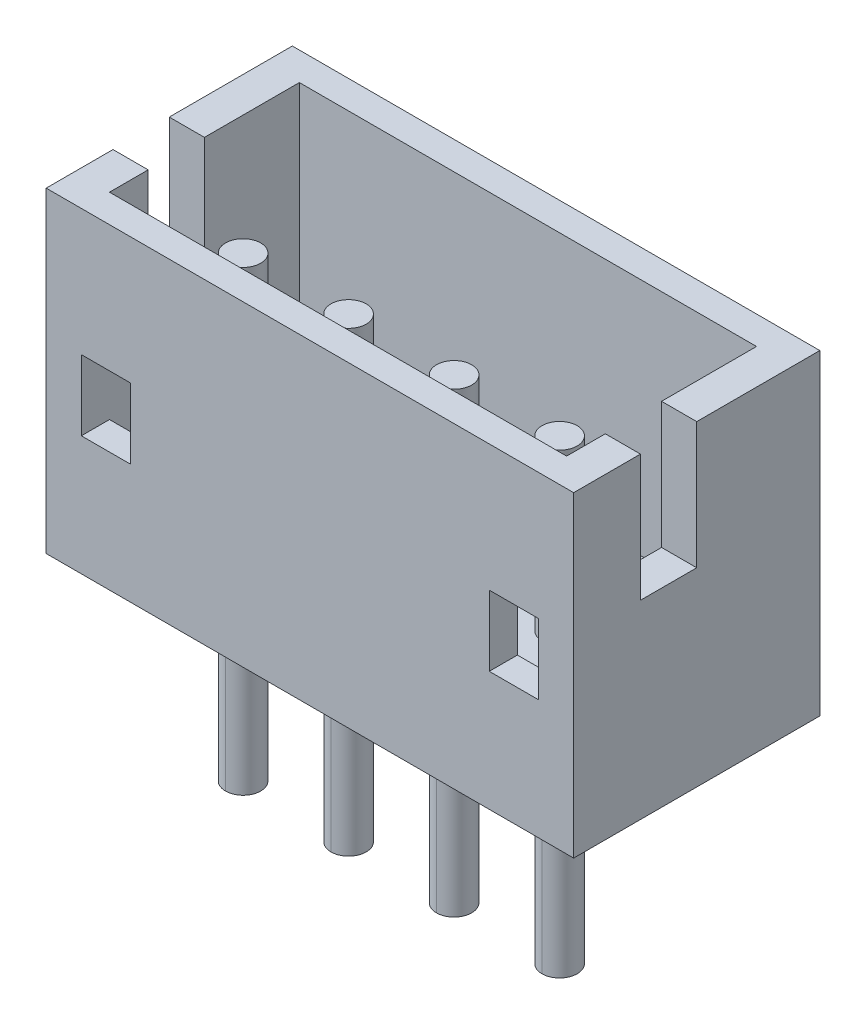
ISO-10303-21;
HEADER;
FILE_DESCRIPTION(('STEP AP214'),'2;1');
FILE_NAME('part.step','',(''),(''),'','','');
FILE_SCHEMA(('AUTOMOTIVE_DESIGN { 1 0 10303 214 1 1 1 1 }'));
ENDSEC;
DATA;
#1=APPLICATION_CONTEXT('core data for automotive mechanical design processes');
#2=APPLICATION_PROTOCOL_DEFINITION('international standard','automotive_design',2000,#1);
#3=PRODUCT_CONTEXT('',#1,'mechanical');
#4=PRODUCT('Part','Part','',(#3));
#5=PRODUCT_RELATED_PRODUCT_CATEGORY('part','',(#4));
#6=PRODUCT_DEFINITION_FORMATION('','',#4);
#7=PRODUCT_DEFINITION_CONTEXT('part definition',#1,'design');
#8=PRODUCT_DEFINITION('design','',#6,#7);
#9=PRODUCT_DEFINITION_SHAPE('','',#8);
#10=(LENGTH_UNIT() NAMED_UNIT(*) SI_UNIT(.MILLI.,.METRE.));
#11=(NAMED_UNIT(*) PLANE_ANGLE_UNIT() SI_UNIT($,.RADIAN.));
#12=(NAMED_UNIT(*) SI_UNIT($,.STERADIAN.) SOLID_ANGLE_UNIT());
#13=UNCERTAINTY_MEASURE_WITH_UNIT(LENGTH_MEASURE(1.E-05),#10,'distance_accuracy_value','');
#14=(GEOMETRIC_REPRESENTATION_CONTEXT(3) GLOBAL_UNCERTAINTY_ASSIGNED_CONTEXT((#13)) GLOBAL_UNIT_ASSIGNED_CONTEXT((#10,
#11,#12)) REPRESENTATION_CONTEXT('',''));
#15=CARTESIAN_POINT('',(0.,0.,0.));
#16=DIRECTION('',(0.,0.,1.));
#17=DIRECTION('',(1.,0.,0.));
#18=AXIS2_PLACEMENT_3D('',#15,#16,#17);
#19=CARTESIAN_POINT('',(-0.75,3.8,-1.3));
#20=DIRECTION('',(0.,1.,0.));
#21=DIRECTION('',(1.,0.,0.));
#22=AXIS2_PLACEMENT_3D('',#19,#20,#21);
#23=PLANE('',#22);
#24=CARTESIAN_POINT('',(-0.75,3.8,-1.3));
#25=DIRECTION('',(0.,1.,0.));
#26=DIRECTION('',(0.,0.,1.));
#27=AXIS2_PLACEMENT_3D('',#24,#25,#26);
#28=CIRCLE('',#27,0.25);
#29=CARTESIAN_POINT('',(-0.75,3.8,-1.05));
#30=VERTEX_POINT('',#29);
#31=CARTESIAN_POINT('',(-0.75,3.8,-1.55));
#32=VERTEX_POINT('',#31);
#33=EDGE_CURVE('E20',#30,#32,#28,.T.);
#34=ORIENTED_EDGE('',*,*,#33,.T.);
#35=CARTESIAN_POINT('',(-0.75,3.8,-1.3));
#36=DIRECTION('',(0.,1.,0.));
#37=DIRECTION('',(0.,0.,1.));
#38=AXIS2_PLACEMENT_3D('',#35,#36,#37);
#39=CIRCLE('',#38,0.25);
#40=EDGE_CURVE('E656',#32,#30,#39,.T.);
#41=ORIENTED_EDGE('',*,*,#40,.T.);
#42=EDGE_LOOP('',(#34,#41));
#43=FACE_BOUND('',#42,.T.);
#44=ADVANCED_FACE('F17',(#43),#23,.T.);
#45=CARTESIAN_POINT('',(-2.25,3.8,-1.3));
#46=DIRECTION('',(0.,1.,0.));
#47=DIRECTION('',(1.,0.,0.));
#48=AXIS2_PLACEMENT_3D('',#45,#46,#47);
#49=PLANE('',#48);
#50=CARTESIAN_POINT('',(-2.25,3.8,-1.3));
#51=DIRECTION('',(0.,1.,0.));
#52=DIRECTION('',(0.,0.,1.));
#53=AXIS2_PLACEMENT_3D('',#50,#51,#52);
#54=CIRCLE('',#53,0.25);
#55=CARTESIAN_POINT('',(-2.25,3.8,-1.05));
#56=VERTEX_POINT('',#55);
#57=CARTESIAN_POINT('',(-2.25,3.8,-1.55));
#58=VERTEX_POINT('',#57);
#59=EDGE_CURVE('E443',#56,#58,#54,.T.);
#60=ORIENTED_EDGE('',*,*,#59,.T.);
#61=CARTESIAN_POINT('',(-2.25,3.8,-1.3));
#62=DIRECTION('',(0.,1.,0.));
#63=DIRECTION('',(0.,0.,1.));
#64=AXIS2_PLACEMENT_3D('',#61,#62,#63);
#65=CIRCLE('',#64,0.25);
#66=EDGE_CURVE('E652',#58,#56,#65,.T.);
#67=ORIENTED_EDGE('',*,*,#66,.T.);
#68=EDGE_LOOP('',(#60,#67));
#69=FACE_BOUND('',#68,.T.);
#70=ADVANCED_FACE('F956',(#69),#49,.T.);
#71=CARTESIAN_POINT('',(0.75,3.8,-1.3));
#72=DIRECTION('',(0.,1.,0.));
#73=DIRECTION('',(1.,0.,0.));
#74=AXIS2_PLACEMENT_3D('',#71,#72,#73);
#75=PLANE('',#74);
#76=CARTESIAN_POINT('',(0.75,3.8,-1.3));
#77=DIRECTION('',(0.,1.,0.));
#78=DIRECTION('',(0.,0.,1.));
#79=AXIS2_PLACEMENT_3D('',#76,#77,#78);
#80=CIRCLE('',#79,0.25);
#81=CARTESIAN_POINT('',(0.75,3.8,-1.05));
#82=VERTEX_POINT('',#81);
#83=CARTESIAN_POINT('',(0.75,3.8,-1.55));
#84=VERTEX_POINT('',#83);
#85=EDGE_CURVE('E10',#82,#84,#80,.T.);
#86=ORIENTED_EDGE('',*,*,#85,.T.);
#87=CARTESIAN_POINT('',(0.75,3.8,-1.3));
#88=DIRECTION('',(0.,1.,0.));
#89=DIRECTION('',(0.,0.,1.));
#90=AXIS2_PLACEMENT_3D('',#87,#88,#89);
#91=CIRCLE('',#90,0.25);
#92=EDGE_CURVE('E433',#84,#82,#91,.T.);
#93=ORIENTED_EDGE('',*,*,#92,.T.);
#94=EDGE_LOOP('',(#86,#93));
#95=FACE_BOUND('',#94,.T.);
#96=ADVANCED_FACE('F960',(#95),#75,.T.);
#97=CARTESIAN_POINT('',(2.25,3.8,-1.3));
#98=DIRECTION('',(0.,1.,0.));
#99=DIRECTION('',(1.,0.,0.));
#100=AXIS2_PLACEMENT_3D('',#97,#98,#99);
#101=PLANE('',#100);
#102=CARTESIAN_POINT('',(2.25,3.8,-1.3));
#103=DIRECTION('',(0.,1.,0.));
#104=DIRECTION('',(0.,0.,1.));
#105=AXIS2_PLACEMENT_3D('',#102,#103,#104);
#106=CIRCLE('',#105,0.25);
#107=CARTESIAN_POINT('',(2.25,3.8,-1.05));
#108=VERTEX_POINT('',#107);
#109=CARTESIAN_POINT('',(2.25,3.8,-1.55));
#110=VERTEX_POINT('',#109);
#111=EDGE_CURVE('E655',#108,#110,#106,.T.);
#112=ORIENTED_EDGE('',*,*,#111,.T.);
#113=CARTESIAN_POINT('',(2.25,3.8,-1.3));
#114=DIRECTION('',(0.,1.,0.));
#115=DIRECTION('',(0.,0.,1.));
#116=AXIS2_PLACEMENT_3D('',#113,#114,#115);
#117=CIRCLE('',#116,0.25);
#118=EDGE_CURVE('E410',#110,#108,#117,.T.);
#119=ORIENTED_EDGE('',*,*,#118,.T.);
#120=EDGE_LOOP('',(#112,#119));
#121=FACE_BOUND('',#120,.T.);
#122=ADVANCED_FACE('F965',(#121),#101,.T.);
#123=CARTESIAN_POINT('',(0.75,-2.7,-1.3));
#124=DIRECTION('',(0.,1.,0.));
#125=DIRECTION('',(0.,0.,1.));
#126=AXIS2_PLACEMENT_3D('',#123,#124,#125);
#127=CYLINDRICAL_SURFACE('',#126,0.25);
#128=CARTESIAN_POINT('',(0.75,1.4,-1.3));
#129=DIRECTION('',(0.,1.,0.));
#130=DIRECTION('',(0.,0.,1.));
#131=AXIS2_PLACEMENT_3D('',#128,#129,#130);
#132=CIRCLE('',#131,0.25);
#133=CARTESIAN_POINT('',(0.75,1.4,-1.05));
#134=VERTEX_POINT('',#133);
#135=CARTESIAN_POINT('',(0.75,1.4,-1.55));
#136=VERTEX_POINT('',#135);
#137=EDGE_CURVE('E517',#134,#136,#132,.T.);
#138=ORIENTED_EDGE('',*,*,#137,.T.);
#139=DIRECTION('',(0.,1.,0.));
#140=VECTOR('',#139,1.);
#141=CARTESIAN_POINT('',(0.75,-2.7,-1.55));
#142=LINE('',#141,#140);
#143=EDGE_CURVE('E405',#136,#84,#142,.T.);
#144=ORIENTED_EDGE('',*,*,#143,.T.);
#145=ORIENTED_EDGE('',*,*,#85,.F.);
#146=DIRECTION('',(0.,1.,0.));
#147=VECTOR('',#146,1.);
#148=CARTESIAN_POINT('',(0.75,-2.7,-1.05));
#149=LINE('',#148,#147);
#150=EDGE_CURVE('E409',#134,#82,#149,.T.);
#151=ORIENTED_EDGE('',*,*,#150,.F.);
#152=EDGE_LOOP('',(#138,#144,#145,#151));
#153=FACE_BOUND('',#152,.T.);
#154=ADVANCED_FACE('F971',(#153),#127,.T.);
#155=CARTESIAN_POINT('',(-0.75,-2.7,-1.3));
#156=DIRECTION('',(0.,1.,0.));
#157=DIRECTION('',(0.,0.,1.));
#158=AXIS2_PLACEMENT_3D('',#155,#156,#157);
#159=CYLINDRICAL_SURFACE('',#158,0.25);
#160=CARTESIAN_POINT('',(-0.75,1.4,-1.3));
#161=DIRECTION('',(0.,1.,0.));
#162=DIRECTION('',(0.,0.,1.));
#163=AXIS2_PLACEMENT_3D('',#160,#161,#162);
#164=CIRCLE('',#163,0.25);
#165=CARTESIAN_POINT('',(-0.75,1.4,-1.05));
#166=VERTEX_POINT('',#165);
#167=CARTESIAN_POINT('',(-0.75,1.4,-1.55));
#168=VERTEX_POINT('',#167);
#169=EDGE_CURVE('E620',#166,#168,#164,.T.);
#170=ORIENTED_EDGE('',*,*,#169,.T.);
#171=DIRECTION('',(0.,1.,0.));
#172=VECTOR('',#171,1.);
#173=CARTESIAN_POINT('',(-0.75,-2.7,-1.55));
#174=LINE('',#173,#172);
#175=EDGE_CURVE('E548',#168,#32,#174,.T.);
#176=ORIENTED_EDGE('',*,*,#175,.T.);
#177=ORIENTED_EDGE('',*,*,#33,.F.);
#178=DIRECTION('',(0.,1.,0.));
#179=VECTOR('',#178,1.);
#180=CARTESIAN_POINT('',(-0.75,-2.7,-1.05));
#181=LINE('',#180,#179);
#182=EDGE_CURVE('E742',#166,#30,#181,.T.);
#183=ORIENTED_EDGE('',*,*,#182,.F.);
#184=EDGE_LOOP('',(#170,#176,#177,#183));
#185=FACE_BOUND('',#184,.T.);
#186=ADVANCED_FACE('F832',(#185),#159,.T.);
#187=CARTESIAN_POINT('',(2.25,-2.7,-1.3));
#188=DIRECTION('',(0.,1.,0.));
#189=DIRECTION('',(0.,0.,1.));
#190=AXIS2_PLACEMENT_3D('',#187,#188,#189);
#191=CYLINDRICAL_SURFACE('',#190,0.25);
#192=CARTESIAN_POINT('',(2.25,1.4,-1.3));
#193=DIRECTION('',(0.,1.,0.));
#194=DIRECTION('',(0.,0.,1.));
#195=AXIS2_PLACEMENT_3D('',#192,#193,#194);
#196=CIRCLE('',#195,0.25);
#197=CARTESIAN_POINT('',(2.25,1.4,-1.05));
#198=VERTEX_POINT('',#197);
#199=CARTESIAN_POINT('',(2.25,1.4,-1.55));
#200=VERTEX_POINT('',#199);
#201=EDGE_CURVE('E603',#198,#200,#196,.T.);
#202=ORIENTED_EDGE('',*,*,#201,.T.);
#203=DIRECTION('',(0.,1.,0.));
#204=VECTOR('',#203,1.);
#205=CARTESIAN_POINT('',(2.25,-2.7,-1.55));
#206=LINE('',#205,#204);
#207=EDGE_CURVE('E491',#200,#110,#206,.T.);
#208=ORIENTED_EDGE('',*,*,#207,.T.);
#209=ORIENTED_EDGE('',*,*,#111,.F.);
#210=DIRECTION('',(0.,1.,0.));
#211=VECTOR('',#210,1.);
#212=CARTESIAN_POINT('',(2.25,-2.7,-1.05));
#213=LINE('',#212,#211);
#214=EDGE_CURVE('E495',#198,#108,#213,.T.);
#215=ORIENTED_EDGE('',*,*,#214,.F.);
#216=EDGE_LOOP('',(#202,#208,#209,#215));
#217=FACE_BOUND('',#216,.T.);
#218=ADVANCED_FACE('F978',(#217),#191,.T.);
#219=CARTESIAN_POINT('',(-2.25,-2.7,-1.3));
#220=DIRECTION('',(0.,1.,0.));
#221=DIRECTION('',(0.,0.,1.));
#222=AXIS2_PLACEMENT_3D('',#219,#220,#221);
#223=CYLINDRICAL_SURFACE('',#222,0.25);
#224=DIRECTION('',(0.,1.,0.));
#225=VECTOR('',#224,1.);
#226=CARTESIAN_POINT('',(-2.25,-2.7,-1.55));
#227=LINE('',#226,#225);
#228=CARTESIAN_POINT('',(-2.25,1.4,-1.55));
#229=VERTEX_POINT('',#228);
#230=EDGE_CURVE('E437',#229,#58,#227,.T.);
#231=ORIENTED_EDGE('',*,*,#230,.F.);
#232=CARTESIAN_POINT('',(-2.25,1.4,-1.3));
#233=DIRECTION('',(0.,1.,0.));
#234=DIRECTION('',(0.,0.,1.));
#235=AXIS2_PLACEMENT_3D('',#232,#233,#234);
#236=CIRCLE('',#235,0.25);
#237=CARTESIAN_POINT('',(-2.25,1.4,-1.05));
#238=VERTEX_POINT('',#237);
#239=EDGE_CURVE('E698',#229,#238,#236,.T.);
#240=ORIENTED_EDGE('',*,*,#239,.T.);
#241=DIRECTION('',(0.,1.,0.));
#242=VECTOR('',#241,1.);
#243=CARTESIAN_POINT('',(-2.25,-2.7,-1.05));
#244=LINE('',#243,#242);
#245=EDGE_CURVE('E447',#238,#56,#244,.T.);
#246=ORIENTED_EDGE('',*,*,#245,.T.);
#247=ORIENTED_EDGE('',*,*,#66,.F.);
#248=EDGE_LOOP('',(#231,#240,#246,#247));
#249=FACE_BOUND('',#248,.T.);
#250=ADVANCED_FACE('F981',(#249),#223,.T.);
#251=CARTESIAN_POINT('',(-0.75,-2.7,-1.3));
#252=DIRECTION('',(0.,1.,0.));
#253=DIRECTION('',(0.,0.,1.));
#254=AXIS2_PLACEMENT_3D('',#251,#252,#253);
#255=CYLINDRICAL_SURFACE('',#254,0.25);
#256=ORIENTED_EDGE('',*,*,#175,.F.);
#257=CARTESIAN_POINT('',(-0.75,1.4,-1.3));
#258=DIRECTION('',(0.,1.,0.));
#259=DIRECTION('',(0.,0.,1.));
#260=AXIS2_PLACEMENT_3D('',#257,#258,#259);
#261=CIRCLE('',#260,0.25);
#262=EDGE_CURVE('E522',#168,#166,#261,.T.);
#263=ORIENTED_EDGE('',*,*,#262,.T.);
#264=ORIENTED_EDGE('',*,*,#182,.T.);
#265=ORIENTED_EDGE('',*,*,#40,.F.);
#266=EDGE_LOOP('',(#256,#263,#264,#265));
#267=FACE_BOUND('',#266,.T.);
#268=ADVANCED_FACE('F829',(#267),#255,.T.);
#269=CARTESIAN_POINT('',(-2.25,-2.7,-1.3));
#270=DIRECTION('',(0.,1.,0.));
#271=DIRECTION('',(0.,0.,1.));
#272=AXIS2_PLACEMENT_3D('',#269,#270,#271);
#273=CYLINDRICAL_SURFACE('',#272,0.25);
#274=CARTESIAN_POINT('',(-2.25,1.4,-1.3));
#275=DIRECTION('',(0.,1.,0.));
#276=DIRECTION('',(0.,0.,1.));
#277=AXIS2_PLACEMENT_3D('',#274,#275,#276);
#278=CIRCLE('',#277,0.25);
#279=EDGE_CURVE('E451',#238,#229,#278,.T.);
#280=ORIENTED_EDGE('',*,*,#279,.T.);
#281=ORIENTED_EDGE('',*,*,#230,.T.);
#282=ORIENTED_EDGE('',*,*,#59,.F.);
#283=ORIENTED_EDGE('',*,*,#245,.F.);
#284=EDGE_LOOP('',(#280,#281,#282,#283));
#285=FACE_BOUND('',#284,.T.);
#286=ADVANCED_FACE('F985',(#285),#273,.T.);
#287=CARTESIAN_POINT('',(0.75,-2.7,-1.3));
#288=DIRECTION('',(0.,1.,0.));
#289=DIRECTION('',(0.,0.,1.));
#290=AXIS2_PLACEMENT_3D('',#287,#288,#289);
#291=CYLINDRICAL_SURFACE('',#290,0.25);
#292=ORIENTED_EDGE('',*,*,#143,.F.);
#293=CARTESIAN_POINT('',(0.75,1.4,-1.3));
#294=DIRECTION('',(0.,1.,0.));
#295=DIRECTION('',(0.,0.,1.));
#296=AXIS2_PLACEMENT_3D('',#293,#294,#295);
#297=CIRCLE('',#296,0.25);
#298=EDGE_CURVE('E521',#136,#134,#297,.T.);
#299=ORIENTED_EDGE('',*,*,#298,.T.);
#300=ORIENTED_EDGE('',*,*,#150,.T.);
#301=ORIENTED_EDGE('',*,*,#92,.F.);
#302=EDGE_LOOP('',(#292,#299,#300,#301));
#303=FACE_BOUND('',#302,.T.);
#304=ADVANCED_FACE('F987',(#303),#291,.T.);
#305=CARTESIAN_POINT('',(2.25,-2.7,-1.3));
#306=DIRECTION('',(0.,1.,0.));
#307=DIRECTION('',(0.,0.,1.));
#308=AXIS2_PLACEMENT_3D('',#305,#306,#307);
#309=CYLINDRICAL_SURFACE('',#308,0.25);
#310=ORIENTED_EDGE('',*,*,#207,.F.);
#311=CARTESIAN_POINT('',(2.25,1.4,-1.3));
#312=DIRECTION('',(0.,1.,0.));
#313=DIRECTION('',(0.,0.,1.));
#314=AXIS2_PLACEMENT_3D('',#311,#312,#313);
#315=CIRCLE('',#314,0.25);
#316=EDGE_CURVE('E496',#200,#198,#315,.T.);
#317=ORIENTED_EDGE('',*,*,#316,.T.);
#318=ORIENTED_EDGE('',*,*,#214,.T.);
#319=ORIENTED_EDGE('',*,*,#118,.F.);
#320=EDGE_LOOP('',(#310,#317,#318,#319));
#321=FACE_BOUND('',#320,.T.);
#322=ADVANCED_FACE('F838',(#321),#309,.T.);
#323=CARTESIAN_POINT('',(-3.25,1.4,-3.1));
#324=DIRECTION('',(0.,1.,0.));
#325=DIRECTION('',(1.,0.,0.));
#326=AXIS2_PLACEMENT_3D('',#323,#324,#325);
#327=PLANE('',#326);
#328=ORIENTED_EDGE('',*,*,#201,.F.);
#329=ORIENTED_EDGE('',*,*,#316,.F.);
#330=EDGE_LOOP('',(#328,#329));
#331=FACE_BOUND('',#330,.T.);
#332=ORIENTED_EDGE('',*,*,#137,.F.);
#333=ORIENTED_EDGE('',*,*,#298,.F.);
#334=EDGE_LOOP('',(#332,#333));
#335=FACE_BOUND('',#334,.T.);
#336=ORIENTED_EDGE('',*,*,#169,.F.);
#337=ORIENTED_EDGE('',*,*,#262,.F.);
#338=EDGE_LOOP('',(#336,#337));
#339=FACE_BOUND('',#338,.T.);
#340=ORIENTED_EDGE('',*,*,#279,.F.);
#341=ORIENTED_EDGE('',*,*,#239,.F.);
#342=EDGE_LOOP('',(#340,#341));
#343=FACE_BOUND('',#342,.T.);
#344=DIRECTION('',(0.,0.,-1.));
#345=VECTOR('',#344,1.);
#346=CARTESIAN_POINT('',(3.25,1.4,-3.1));
#347=LINE('',#346,#345);
#348=CARTESIAN_POINT('',(3.25,1.4,-0.4));
#349=VERTEX_POINT('',#348);
#350=CARTESIAN_POINT('',(3.25,1.4,-1.75));
#351=VERTEX_POINT('',#350);
#352=EDGE_CURVE('E478',#349,#351,#347,.T.);
#353=ORIENTED_EDGE('',*,*,#352,.T.);
#354=DIRECTION('',(-1.,0.,0.));
#355=VECTOR('',#354,1.);
#356=CARTESIAN_POINT('',(3.25,1.4,-1.75));
#357=LINE('',#356,#355);
#358=CARTESIAN_POINT('',(-3.25,1.4,-1.75));
#359=VERTEX_POINT('',#358);
#360=EDGE_CURVE('E448',#351,#359,#357,.T.);
#361=ORIENTED_EDGE('',*,*,#360,.T.);
#362=DIRECTION('',(0.,0.,1.));
#363=VECTOR('',#362,1.);
#364=CARTESIAN_POINT('',(-3.25,1.4,-3.1));
#365=LINE('',#364,#363);
#366=CARTESIAN_POINT('',(-3.25,1.4,-0.4));
#367=VERTEX_POINT('',#366);
#368=EDGE_CURVE('E631',#359,#367,#365,.T.);
#369=ORIENTED_EDGE('',*,*,#368,.T.);
#370=DIRECTION('',(1.,0.,0.));
#371=VECTOR('',#370,1.);
#372=CARTESIAN_POINT('',(-3.25,1.4,-0.4));
#373=LINE('',#372,#371);
#374=EDGE_CURVE('E500',#367,#349,#373,.T.);
#375=ORIENTED_EDGE('',*,*,#374,.T.);
#376=EDGE_LOOP('',(#353,#361,#369,#375));
#377=FACE_BOUND('',#376,.T.);
#378=ADVANCED_FACE('F834',(#331,#335,#339,#343,#377),#327,.T.);
#379=CARTESIAN_POINT('',(3.25,1.1,-2.05));
#380=DIRECTION('',(0.,0.707106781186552,-0.707106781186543));
#381=DIRECTION('',(-1.,0.,0.));
#382=AXIS2_PLACEMENT_3D('',#379,#380,#381);
#383=PLANE('',#382);
#384=DIRECTION('',(0.,-0.707106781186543,-0.707106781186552));
#385=VECTOR('',#384,1.);
#386=CARTESIAN_POINT('',(-3.25,1.1,-2.05));
#387=LINE('',#386,#385);
#388=CARTESIAN_POINT('',(-3.25,1.1,-2.05));
#389=VERTEX_POINT('',#388);
#390=EDGE_CURVE('E635',#359,#389,#387,.T.);
#391=ORIENTED_EDGE('',*,*,#390,.F.);
#392=ORIENTED_EDGE('',*,*,#360,.F.);
#393=DIRECTION('',(0.,-0.707106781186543,-0.707106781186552));
#394=VECTOR('',#393,1.);
#395=CARTESIAN_POINT('',(3.25,1.1,-2.05));
#396=LINE('',#395,#394);
#397=CARTESIAN_POINT('',(3.25,1.1,-2.05));
#398=VERTEX_POINT('',#397);
#399=EDGE_CURVE('E508',#351,#398,#396,.T.);
#400=ORIENTED_EDGE('',*,*,#399,.T.);
#401=DIRECTION('',(-1.,0.,0.));
#402=VECTOR('',#401,1.);
#403=CARTESIAN_POINT('',(3.25,1.1,-2.05));
#404=LINE('',#403,#402);
#405=EDGE_CURVE('E452',#398,#389,#404,.T.);
#406=ORIENTED_EDGE('',*,*,#405,.T.);
#407=EDGE_LOOP('',(#391,#392,#400,#406));
#408=FACE_BOUND('',#407,.T.);
#409=ADVANCED_FACE('F837',(#408),#383,.T.);
#410=CARTESIAN_POINT('',(3.25,1.1,-3.1));
#411=DIRECTION('',(0.,1.,0.));
#412=DIRECTION('',(0.,0.,-1.));
#413=AXIS2_PLACEMENT_3D('',#410,#411,#412);
#414=PLANE('',#413);
#415=DIRECTION('',(0.,0.,-1.));
#416=VECTOR('',#415,1.);
#417=CARTESIAN_POINT('',(-3.25,1.1,-3.1));
#418=LINE('',#417,#416);
#419=CARTESIAN_POINT('',(-3.25,1.1,-3.1));
#420=VERTEX_POINT('',#419);
#421=EDGE_CURVE('E787',#389,#420,#418,.T.);
#422=ORIENTED_EDGE('',*,*,#421,.F.);
#423=ORIENTED_EDGE('',*,*,#405,.F.);
#424=DIRECTION('',(0.,0.,-1.));
#425=VECTOR('',#424,1.);
#426=CARTESIAN_POINT('',(3.25,1.1,-3.1));
#427=LINE('',#426,#425);
#428=CARTESIAN_POINT('',(3.25,1.1,-3.1));
#429=VERTEX_POINT('',#428);
#430=EDGE_CURVE('E512',#398,#429,#427,.T.);
#431=ORIENTED_EDGE('',*,*,#430,.T.);
#432=DIRECTION('',(-1.,0.,0.));
#433=VECTOR('',#432,1.);
#434=CARTESIAN_POINT('',(3.25,1.1,-3.1));
#435=LINE('',#434,#433);
#436=EDGE_CURVE('E503',#429,#420,#435,.T.);
#437=ORIENTED_EDGE('',*,*,#436,.T.);
#438=EDGE_LOOP('',(#422,#423,#431,#437));
#439=FACE_BOUND('',#438,.T.);
#440=ADVANCED_FACE('F915',(#439),#414,.T.);
#441=CARTESIAN_POINT('',(-3.25,1.4,-3.1));
#442=DIRECTION('',(0.,0.,-1.));
#443=DIRECTION('',(-1.,0.,0.));
#444=AXIS2_PLACEMENT_3D('',#441,#442,#443);
#445=PLANE('',#444);
#446=DIRECTION('',(-1.,0.,0.));
#447=VECTOR('',#446,1.);
#448=CARTESIAN_POINT('',(-3.25,4.5,-3.1));
#449=LINE('',#448,#447);
#450=CARTESIAN_POINT('',(3.25,4.5,-3.1));
#451=VERTEX_POINT('',#450);
#452=CARTESIAN_POINT('',(-3.25,4.5,-3.1));
#453=VERTEX_POINT('',#452);
#454=EDGE_CURVE('E718',#451,#453,#449,.T.);
#455=ORIENTED_EDGE('',*,*,#454,.T.);
#456=DIRECTION('',(0.,1.,0.));
#457=VECTOR('',#456,1.);
#458=CARTESIAN_POINT('',(-3.25,1.4,-3.1));
#459=LINE('',#458,#457);
#460=EDGE_CURVE('E751',#420,#453,#459,.T.);
#461=ORIENTED_EDGE('',*,*,#460,.F.);
#462=ORIENTED_EDGE('',*,*,#436,.F.);
#463=DIRECTION('',(0.,1.,0.));
#464=VECTOR('',#463,1.);
#465=CARTESIAN_POINT('',(3.25,1.4,-3.1));
#466=LINE('',#465,#464);
#467=EDGE_CURVE('E750',#429,#451,#466,.T.);
#468=ORIENTED_EDGE('',*,*,#467,.T.);
#469=EDGE_LOOP('',(#455,#461,#462,#468));
#470=FACE_BOUND('',#469,.T.);
#471=ADVANCED_FACE('F913',(#470),#445,.F.);
#472=CARTESIAN_POINT('',(-3.25,1.4,-0.4));
#473=DIRECTION('',(0.,0.,1.));
#474=DIRECTION('',(1.,0.,0.));
#475=AXIS2_PLACEMENT_3D('',#472,#473,#474);
#476=PLANE('',#475);
#477=DIRECTION('',(0.,1.,0.));
#478=VECTOR('',#477,1.);
#479=CARTESIAN_POINT('',(3.25,1.4,-0.4));
#480=LINE('',#479,#478);
#481=CARTESIAN_POINT('',(3.25,2.7,-0.4));
#482=VERTEX_POINT('',#481);
#483=CARTESIAN_POINT('',(3.25,4.5,-0.4));
#484=VERTEX_POINT('',#483);
#485=EDGE_CURVE('E533',#482,#484,#480,.T.);
#486=ORIENTED_EDGE('',*,*,#485,.F.);
#487=DIRECTION('',(1.,0.,0.));
#488=VECTOR('',#487,1.);
#489=CARTESIAN_POINT('',(3.25,2.7,-0.4));
#490=LINE('',#489,#488);
#491=CARTESIAN_POINT('',(2.55,2.7,-0.4));
#492=VERTEX_POINT('',#491);
#493=EDGE_CURVE('E536',#492,#482,#490,.T.);
#494=ORIENTED_EDGE('',*,*,#493,.F.);
#495=DIRECTION('',(0.,1.,0.));
#496=VECTOR('',#495,1.);
#497=CARTESIAN_POINT('',(2.55,2.7,-0.4));
#498=LINE('',#497,#496);
#499=CARTESIAN_POINT('',(2.55,1.7,-0.4));
#500=VERTEX_POINT('',#499);
#501=EDGE_CURVE('E761',#500,#492,#498,.T.);
#502=ORIENTED_EDGE('',*,*,#501,.F.);
#503=DIRECTION('',(-1.,0.,0.));
#504=VECTOR('',#503,1.);
#505=CARTESIAN_POINT('',(3.25,1.7,-0.4));
#506=LINE('',#505,#504);
#507=CARTESIAN_POINT('',(3.25,1.7,-0.4));
#508=VERTEX_POINT('',#507);
#509=EDGE_CURVE('E727',#508,#500,#506,.T.);
#510=ORIENTED_EDGE('',*,*,#509,.F.);
#511=DIRECTION('',(0.,1.,0.));
#512=VECTOR('',#511,1.);
#513=CARTESIAN_POINT('',(3.25,1.4,-0.4));
#514=LINE('',#513,#512);
#515=EDGE_CURVE('E474',#349,#508,#514,.T.);
#516=ORIENTED_EDGE('',*,*,#515,.F.);
#517=ORIENTED_EDGE('',*,*,#374,.F.);
#518=DIRECTION('',(0.,1.,0.));
#519=VECTOR('',#518,1.);
#520=CARTESIAN_POINT('',(-3.25,1.4,-0.4));
#521=LINE('',#520,#519);
#522=CARTESIAN_POINT('',(-3.25,1.7,-0.4));
#523=VERTEX_POINT('',#522);
#524=EDGE_CURVE('E636',#367,#523,#521,.T.);
#525=ORIENTED_EDGE('',*,*,#524,.T.);
#526=DIRECTION('',(-1.,0.,0.));
#527=VECTOR('',#526,1.);
#528=CARTESIAN_POINT('',(-3.25,1.7,-0.4));
#529=LINE('',#528,#527);
#530=CARTESIAN_POINT('',(-2.55,1.7,-0.4));
#531=VERTEX_POINT('',#530);
#532=EDGE_CURVE('E741',#531,#523,#529,.T.);
#533=ORIENTED_EDGE('',*,*,#532,.F.);
#534=DIRECTION('',(0.,-1.,0.));
#535=VECTOR('',#534,1.);
#536=CARTESIAN_POINT('',(-2.55,2.7,-0.4));
#537=LINE('',#536,#535);
#538=CARTESIAN_POINT('',(-2.55,2.7,-0.4));
#539=VERTEX_POINT('',#538);
#540=EDGE_CURVE('E659',#539,#531,#537,.T.);
#541=ORIENTED_EDGE('',*,*,#540,.F.);
#542=DIRECTION('',(1.,0.,0.));
#543=VECTOR('',#542,1.);
#544=CARTESIAN_POINT('',(-3.25,2.7,-0.4));
#545=LINE('',#544,#543);
#546=CARTESIAN_POINT('',(-3.25,2.7,-0.4));
#547=VERTEX_POINT('',#546);
#548=EDGE_CURVE('E523',#547,#539,#545,.T.);
#549=ORIENTED_EDGE('',*,*,#548,.F.);
#550=DIRECTION('',(0.,1.,0.));
#551=VECTOR('',#550,1.);
#552=CARTESIAN_POINT('',(-3.25,1.4,-0.4));
#553=LINE('',#552,#551);
#554=CARTESIAN_POINT('',(-3.25,4.5,-0.4));
#555=VERTEX_POINT('',#554);
#556=EDGE_CURVE('E647',#547,#555,#553,.T.);
#557=ORIENTED_EDGE('',*,*,#556,.T.);
#558=DIRECTION('',(1.,0.,0.));
#559=VECTOR('',#558,1.);
#560=CARTESIAN_POINT('',(-3.25,4.5,-0.4));
#561=LINE('',#560,#559);
#562=EDGE_CURVE('E561',#555,#484,#561,.T.);
#563=ORIENTED_EDGE('',*,*,#562,.T.);
#564=EDGE_LOOP('',(#486,#494,#502,#510,#516,#517,#525,#533,#541,#549,#557,#563));
#565=FACE_BOUND('',#564,.T.);
#566=ADVANCED_FACE('F865',(#565),#476,.F.);
#567=CARTESIAN_POINT('',(-3.75,2.7,-0.95));
#568=DIRECTION('',(0.,-1.,0.));
#569=DIRECTION('',(0.,0.,-1.));
#570=AXIS2_PLACEMENT_3D('',#567,#568,#569);
#571=PLANE('',#570);
#572=DIRECTION('',(1.,0.,0.));
#573=VECTOR('',#572,1.);
#574=CARTESIAN_POINT('',(-3.75,2.7,-1.75));
#575=LINE('',#574,#573);
#576=CARTESIAN_POINT('',(-3.75,2.7,-1.75));
#577=VERTEX_POINT('',#576);
#578=CARTESIAN_POINT('',(-3.25,2.7,-1.75));
#579=VERTEX_POINT('',#578);
#580=EDGE_CURVE('E504',#577,#579,#575,.T.);
#581=ORIENTED_EDGE('',*,*,#580,.F.);
#582=DIRECTION('',(0.,0.,-1.));
#583=VECTOR('',#582,1.);
#584=CARTESIAN_POINT('',(-3.75,2.7,-0.95));
#585=LINE('',#584,#583);
#586=CARTESIAN_POINT('',(-3.75,2.7,-0.95));
#587=VERTEX_POINT('',#586);
#588=EDGE_CURVE('E458',#587,#577,#585,.T.);
#589=ORIENTED_EDGE('',*,*,#588,.F.);
#590=DIRECTION('',(1.,0.,0.));
#591=VECTOR('',#590,1.);
#592=CARTESIAN_POINT('',(-3.75,2.7,-0.95));
#593=LINE('',#592,#591);
#594=CARTESIAN_POINT('',(-3.25,2.7,-0.95));
#595=VERTEX_POINT('',#594);
#596=EDGE_CURVE('E781',#587,#595,#593,.T.);
#597=ORIENTED_EDGE('',*,*,#596,.T.);
#598=DIRECTION('',(0.,0.,1.));
#599=VECTOR('',#598,1.);
#600=CARTESIAN_POINT('',(-3.25,2.7,-3.1));
#601=LINE('',#600,#599);
#602=EDGE_CURVE('E772',#579,#595,#601,.T.);
#603=ORIENTED_EDGE('',*,*,#602,.F.);
#604=EDGE_LOOP('',(#581,#589,#597,#603));
#605=FACE_BOUND('',#604,.T.);
#606=ADVANCED_FACE('F922',(#605),#571,.F.);
#607=CARTESIAN_POINT('',(-3.75,4.5,-1.75));
#608=DIRECTION('',(0.,0.,-1.));
#609=DIRECTION('',(-1.,0.,0.));
#610=AXIS2_PLACEMENT_3D('',#607,#608,#609);
#611=PLANE('',#610);
#612=DIRECTION('',(1.,0.,0.));
#613=VECTOR('',#612,1.);
#614=CARTESIAN_POINT('',(-3.75,4.5,-1.75));
#615=LINE('',#614,#613);
#616=CARTESIAN_POINT('',(-3.75,4.5,-1.75));
#617=VERTEX_POINT('',#616);
#618=CARTESIAN_POINT('',(-3.25,4.5,-1.75));
#619=VERTEX_POINT('',#618);
#620=EDGE_CURVE('E710',#617,#619,#615,.T.);
#621=ORIENTED_EDGE('',*,*,#620,.F.);
#622=DIRECTION('',(0.,1.,0.));
#623=VECTOR('',#622,1.);
#624=CARTESIAN_POINT('',(-3.75,4.5,-1.75));
#625=LINE('',#624,#623);
#626=EDGE_CURVE('E453',#577,#617,#625,.T.);
#627=ORIENTED_EDGE('',*,*,#626,.F.);
#628=ORIENTED_EDGE('',*,*,#580,.T.);
#629=DIRECTION('',(0.,-1.,0.));
#630=VECTOR('',#629,1.);
#631=CARTESIAN_POINT('',(-3.25,1.4,-1.75));
#632=LINE('',#631,#630);
#633=EDGE_CURVE('E746',#619,#579,#632,.T.);
#634=ORIENTED_EDGE('',*,*,#633,.F.);
#635=EDGE_LOOP('',(#621,#627,#628,#634));
#636=FACE_BOUND('',#635,.T.);
#637=ADVANCED_FACE('F919',(#636),#611,.F.);
#638=CARTESIAN_POINT('',(-3.75,4.5,-0.95));
#639=DIRECTION('',(0.,0.,1.));
#640=DIRECTION('',(0.,-1.,0.));
#641=AXIS2_PLACEMENT_3D('',#638,#639,#640);
#642=PLANE('',#641);
#643=ORIENTED_EDGE('',*,*,#596,.F.);
#644=DIRECTION('',(0.,-1.,0.));
#645=VECTOR('',#644,1.);
#646=CARTESIAN_POINT('',(-3.75,4.5,-0.95));
#647=LINE('',#646,#645);
#648=CARTESIAN_POINT('',(-3.75,4.5,-0.95));
#649=VERTEX_POINT('',#648);
#650=EDGE_CURVE('E576',#649,#587,#647,.T.);
#651=ORIENTED_EDGE('',*,*,#650,.F.);
#652=DIRECTION('',(1.,0.,0.));
#653=VECTOR('',#652,1.);
#654=CARTESIAN_POINT('',(-3.75,4.5,-0.95));
#655=LINE('',#654,#653);
#656=CARTESIAN_POINT('',(-3.25,4.5,-0.95));
#657=VERTEX_POINT('',#656);
#658=EDGE_CURVE('E560',#649,#657,#655,.T.);
#659=ORIENTED_EDGE('',*,*,#658,.T.);
#660=DIRECTION('',(0.,1.,0.));
#661=VECTOR('',#660,1.);
#662=CARTESIAN_POINT('',(-3.25,1.4,-0.95));
#663=LINE('',#662,#661);
#664=EDGE_CURVE('E776',#595,#657,#663,.T.);
#665=ORIENTED_EDGE('',*,*,#664,.F.);
#666=EDGE_LOOP('',(#643,#651,#659,#665));
#667=FACE_BOUND('',#666,.T.);
#668=ADVANCED_FACE('F926',(#667),#642,.F.);
#669=CARTESIAN_POINT('',(0.75,-2.7,-1.3));
#670=DIRECTION('',(0.,1.,0.));
#671=DIRECTION('',(1.,0.,0.));
#672=AXIS2_PLACEMENT_3D('',#669,#670,#671);
#673=PLANE('',#672);
#674=CARTESIAN_POINT('',(0.75,-2.7,-1.3));
#675=DIRECTION('',(0.,1.,0.));
#676=DIRECTION('',(0.,0.,1.));
#677=AXIS2_PLACEMENT_3D('',#674,#675,#676);
#678=CIRCLE('',#677,0.25);
#679=CARTESIAN_POINT('',(0.75,-2.7,-1.05));
#680=VERTEX_POINT('',#679);
#681=CARTESIAN_POINT('',(0.75,-2.7,-1.55));
#682=VERTEX_POINT('',#681);
#683=EDGE_CURVE('E438',#680,#682,#678,.T.);
#684=ORIENTED_EDGE('',*,*,#683,.F.);
#685=CARTESIAN_POINT('',(0.75,-2.7,-1.3));
#686=DIRECTION('',(0.,1.,0.));
#687=DIRECTION('',(0.,0.,1.));
#688=AXIS2_PLACEMENT_3D('',#685,#686,#687);
#689=CIRCLE('',#688,0.25);
#690=EDGE_CURVE('E609',#682,#680,#689,.T.);
#691=ORIENTED_EDGE('',*,*,#690,.F.);
#692=EDGE_LOOP('',(#684,#691));
#693=FACE_BOUND('',#692,.T.);
#694=ADVANCED_FACE('F1000',(#693),#673,.F.);
#695=CARTESIAN_POINT('',(-2.25,-2.7,-1.3));
#696=DIRECTION('',(0.,1.,0.));
#697=DIRECTION('',(1.,0.,0.));
#698=AXIS2_PLACEMENT_3D('',#695,#696,#697);
#699=PLANE('',#698);
#700=CARTESIAN_POINT('',(-2.25,-2.7,-1.3));
#701=DIRECTION('',(0.,1.,0.));
#702=DIRECTION('',(0.,0.,1.));
#703=AXIS2_PLACEMENT_3D('',#700,#701,#702);
#704=CIRCLE('',#703,0.25);
#705=CARTESIAN_POINT('',(-2.25,-2.7,-1.05));
#706=VERTEX_POINT('',#705);
#707=CARTESIAN_POINT('',(-2.25,-2.7,-1.55));
#708=VERTEX_POINT('',#707);
#709=EDGE_CURVE('E420',#706,#708,#704,.T.);
#710=ORIENTED_EDGE('',*,*,#709,.F.);
#711=CARTESIAN_POINT('',(-2.25,-2.7,-1.3));
#712=DIRECTION('',(0.,1.,0.));
#713=DIRECTION('',(0.,0.,1.));
#714=AXIS2_PLACEMENT_3D('',#711,#712,#713);
#715=CIRCLE('',#714,0.25);
#716=EDGE_CURVE('E421',#708,#706,#715,.T.);
#717=ORIENTED_EDGE('',*,*,#716,.F.);
#718=EDGE_LOOP('',(#710,#717));
#719=FACE_BOUND('',#718,.T.);
#720=ADVANCED_FACE('F1003',(#719),#699,.F.);
#721=CARTESIAN_POINT('',(-0.75,-2.7,-1.3));
#722=DIRECTION('',(0.,1.,0.));
#723=DIRECTION('',(1.,0.,0.));
#724=AXIS2_PLACEMENT_3D('',#721,#722,#723);
#725=PLANE('',#724);
#726=CARTESIAN_POINT('',(-0.75,-2.7,-1.3));
#727=DIRECTION('',(0.,1.,0.));
#728=DIRECTION('',(0.,0.,1.));
#729=AXIS2_PLACEMENT_3D('',#726,#727,#728);
#730=CIRCLE('',#729,0.25);
#731=CARTESIAN_POINT('',(-0.75,-2.7,-1.05));
#732=VERTEX_POINT('',#731);
#733=CARTESIAN_POINT('',(-0.75,-2.7,-1.55));
#734=VERTEX_POINT('',#733);
#735=EDGE_CURVE('E470',#732,#734,#730,.T.);
#736=ORIENTED_EDGE('',*,*,#735,.F.);
#737=CARTESIAN_POINT('',(-0.75,-2.7,-1.3));
#738=DIRECTION('',(0.,1.,0.));
#739=DIRECTION('',(0.,0.,1.));
#740=AXIS2_PLACEMENT_3D('',#737,#738,#739);
#741=CIRCLE('',#740,0.25);
#742=EDGE_CURVE('E686',#734,#732,#741,.T.);
#743=ORIENTED_EDGE('',*,*,#742,.F.);
#744=EDGE_LOOP('',(#736,#743));
#745=FACE_BOUND('',#744,.T.);
#746=ADVANCED_FACE('F1005',(#745),#725,.F.);
#747=CARTESIAN_POINT('',(-2.55,2.7,-3.501));
#748=DIRECTION('',(1.,0.,0.));
#749=DIRECTION('',(0.,1.,0.));
#750=AXIS2_PLACEMENT_3D('',#747,#748,#749);
#751=PLANE('',#750);
#752=ORIENTED_EDGE('',*,*,#540,.T.);
#753=DIRECTION('',(0.,0.,1.));
#754=VECTOR('',#753,1.);
#755=CARTESIAN_POINT('',(-2.55,1.7,-3.501));
#756=LINE('',#755,#754);
#757=CARTESIAN_POINT('',(-2.55,1.7,0.));
#758=VERTEX_POINT('',#757);
#759=EDGE_CURVE('E732',#531,#758,#756,.T.);
#760=ORIENTED_EDGE('',*,*,#759,.T.);
#761=DIRECTION('',(0.,1.,0.));
#762=VECTOR('',#761,1.);
#763=CARTESIAN_POINT('',(-2.55,2.7,0.));
#764=LINE('',#763,#762);
#765=CARTESIAN_POINT('',(-2.55,2.7,0.));
#766=VERTEX_POINT('',#765);
#767=EDGE_CURVE('E630',#758,#766,#764,.T.);
#768=ORIENTED_EDGE('',*,*,#767,.T.);
#769=DIRECTION('',(0.,0.,1.));
#770=VECTOR('',#769,1.);
#771=CARTESIAN_POINT('',(-2.55,2.7,-3.501));
#772=LINE('',#771,#770);
#773=EDGE_CURVE('E527',#539,#766,#772,.T.);
#774=ORIENTED_EDGE('',*,*,#773,.F.);
#775=EDGE_LOOP('',(#752,#760,#768,#774));
#776=FACE_BOUND('',#775,.T.);
#777=ADVANCED_FACE('F1008',(#776),#751,.F.);
#778=CARTESIAN_POINT('',(3.25,2.7,-3.501));
#779=DIRECTION('',(0.,1.,0.));
#780=DIRECTION('',(1.,0.,0.));
#781=AXIS2_PLACEMENT_3D('',#778,#779,#780);
#782=PLANE('',#781);
#783=ORIENTED_EDGE('',*,*,#493,.T.);
#784=DIRECTION('',(0.,0.,1.));
#785=VECTOR('',#784,1.);
#786=CARTESIAN_POINT('',(3.25,2.7,-3.501));
#787=LINE('',#786,#785);
#788=CARTESIAN_POINT('',(3.25,2.7,0.));
#789=VERTEX_POINT('',#788);
#790=EDGE_CURVE('E477',#482,#789,#787,.T.);
#791=ORIENTED_EDGE('',*,*,#790,.T.);
#792=DIRECTION('',(-1.,0.,0.));
#793=VECTOR('',#792,1.);
#794=CARTESIAN_POINT('',(3.25,2.7,0.));
#795=LINE('',#794,#793);
#796=CARTESIAN_POINT('',(2.55,2.7,0.));
#797=VERTEX_POINT('',#796);
#798=EDGE_CURVE('E602',#789,#797,#795,.T.);
#799=ORIENTED_EDGE('',*,*,#798,.T.);
#800=DIRECTION('',(0.,0.,1.));
#801=VECTOR('',#800,1.);
#802=CARTESIAN_POINT('',(2.55,2.7,-3.501));
#803=LINE('',#802,#801);
#804=EDGE_CURVE('E769',#492,#797,#803,.T.);
#805=ORIENTED_EDGE('',*,*,#804,.F.);
#806=EDGE_LOOP('',(#783,#791,#799,#805));
#807=FACE_BOUND('',#806,.T.);
#808=ADVANCED_FACE('F880',(#807),#782,.F.);
#809=CARTESIAN_POINT('',(3.25,1.4,-3.1));
#810=DIRECTION('',(1.,0.,0.));
#811=DIRECTION('',(0.,1.,0.));
#812=AXIS2_PLACEMENT_3D('',#809,#810,#811);
#813=PLANE('',#812);
#814=DIRECTION('',(0.,0.,-1.));
#815=VECTOR('',#814,1.);
#816=CARTESIAN_POINT('',(3.25,4.5,-3.1));
#817=LINE('',#816,#815);
#818=CARTESIAN_POINT('',(3.25,4.5,-0.95));
#819=VERTEX_POINT('',#818);
#820=EDGE_CURVE('E540',#484,#819,#817,.T.);
#821=ORIENTED_EDGE('',*,*,#820,.T.);
#822=DIRECTION('',(0.,-1.,0.));
#823=VECTOR('',#822,1.);
#824=CARTESIAN_POINT('',(3.25,1.4,-0.95));
#825=LINE('',#824,#823);
#826=CARTESIAN_POINT('',(3.25,2.7,-0.95));
#827=VERTEX_POINT('',#826);
#828=EDGE_CURVE('E528',#819,#827,#825,.T.);
#829=ORIENTED_EDGE('',*,*,#828,.T.);
#830=DIRECTION('',(0.,0.,-1.));
#831=VECTOR('',#830,1.);
#832=CARTESIAN_POINT('',(3.25,2.7,-3.1));
#833=LINE('',#832,#831);
#834=CARTESIAN_POINT('',(3.25,2.7,-1.75));
#835=VERTEX_POINT('',#834);
#836=EDGE_CURVE('E541',#827,#835,#833,.T.);
#837=ORIENTED_EDGE('',*,*,#836,.T.);
#838=DIRECTION('',(0.,1.,0.));
#839=VECTOR('',#838,1.);
#840=CARTESIAN_POINT('',(3.25,1.4,-1.75));
#841=LINE('',#840,#839);
#842=CARTESIAN_POINT('',(3.25,4.5,-1.75));
#843=VERTEX_POINT('',#842);
#844=EDGE_CURVE('E411',#835,#843,#841,.T.);
#845=ORIENTED_EDGE('',*,*,#844,.T.);
#846=DIRECTION('',(0.,0.,-1.));
#847=VECTOR('',#846,1.);
#848=CARTESIAN_POINT('',(3.25,4.5,-3.1));
#849=LINE('',#848,#847);
#850=EDGE_CURVE('E594',#843,#451,#849,.T.);
#851=ORIENTED_EDGE('',*,*,#850,.T.);
#852=ORIENTED_EDGE('',*,*,#467,.F.);
#853=ORIENTED_EDGE('',*,*,#430,.F.);
#854=ORIENTED_EDGE('',*,*,#399,.F.);
#855=ORIENTED_EDGE('',*,*,#352,.F.);
#856=ORIENTED_EDGE('',*,*,#515,.T.);
#857=DIRECTION('',(0.,0.,1.));
#858=VECTOR('',#857,1.);
#859=CARTESIAN_POINT('',(3.25,1.7,-3.501));
#860=LINE('',#859,#858);
#861=CARTESIAN_POINT('',(3.25,1.7,0.));
#862=VERTEX_POINT('',#861);
#863=EDGE_CURVE('E758',#508,#862,#860,.T.);
#864=ORIENTED_EDGE('',*,*,#863,.T.);
#865=DIRECTION('',(0.,1.,0.));
#866=VECTOR('',#865,1.);
#867=CARTESIAN_POINT('',(3.25,2.7,0.));
#868=LINE('',#867,#866);
#869=EDGE_CURVE('E616',#862,#789,#868,.T.);
#870=ORIENTED_EDGE('',*,*,#869,.T.);
#871=ORIENTED_EDGE('',*,*,#790,.F.);
#872=ORIENTED_EDGE('',*,*,#485,.T.);
#873=EDGE_LOOP('',(#821,#829,#837,#845,#851,#852,#853,#854,#855,#856,#864,#870,#871,#872));
#874=FACE_BOUND('',#873,.T.);
#875=ADVANCED_FACE('F853',(#874),#813,.F.);
#876=CARTESIAN_POINT('',(-3.25,1.4,-3.1));
#877=DIRECTION('',(-1.,0.,0.));
#878=DIRECTION('',(0.,0.,1.));
#879=AXIS2_PLACEMENT_3D('',#876,#877,#878);
#880=PLANE('',#879);
#881=ORIENTED_EDGE('',*,*,#602,.T.);
#882=ORIENTED_EDGE('',*,*,#664,.T.);
#883=DIRECTION('',(0.,0.,1.));
#884=VECTOR('',#883,1.);
#885=CARTESIAN_POINT('',(-3.25,4.5,-3.1));
#886=LINE('',#885,#884);
#887=EDGE_CURVE('E556',#657,#555,#886,.T.);
#888=ORIENTED_EDGE('',*,*,#887,.T.);
#889=ORIENTED_EDGE('',*,*,#556,.F.);
#890=DIRECTION('',(0.,0.,1.));
#891=VECTOR('',#890,1.);
#892=CARTESIAN_POINT('',(-3.25,2.7,-3.501));
#893=LINE('',#892,#891);
#894=CARTESIAN_POINT('',(-3.25,2.7,0.));
#895=VERTEX_POINT('',#894);
#896=EDGE_CURVE('E738',#547,#895,#893,.T.);
#897=ORIENTED_EDGE('',*,*,#896,.T.);
#898=DIRECTION('',(0.,-1.,0.));
#899=VECTOR('',#898,1.);
#900=CARTESIAN_POINT('',(-3.25,2.7,0.));
#901=LINE('',#900,#899);
#902=CARTESIAN_POINT('',(-3.25,1.7,0.));
#903=VERTEX_POINT('',#902);
#904=EDGE_CURVE('E471',#895,#903,#901,.T.);
#905=ORIENTED_EDGE('',*,*,#904,.T.);
#906=DIRECTION('',(0.,0.,1.));
#907=VECTOR('',#906,1.);
#908=CARTESIAN_POINT('',(-3.25,1.7,-3.501));
#909=LINE('',#908,#907);
#910=EDGE_CURVE('E755',#523,#903,#909,.T.);
#911=ORIENTED_EDGE('',*,*,#910,.F.);
#912=ORIENTED_EDGE('',*,*,#524,.F.);
#913=ORIENTED_EDGE('',*,*,#368,.F.);
#914=ORIENTED_EDGE('',*,*,#390,.T.);
#915=ORIENTED_EDGE('',*,*,#421,.T.);
#916=ORIENTED_EDGE('',*,*,#460,.T.);
#917=DIRECTION('',(0.,0.,1.));
#918=VECTOR('',#917,1.);
#919=CARTESIAN_POINT('',(-3.25,4.5,-3.1));
#920=LINE('',#919,#918);
#921=EDGE_CURVE('E714',#453,#619,#920,.T.);
#922=ORIENTED_EDGE('',*,*,#921,.T.);
#923=ORIENTED_EDGE('',*,*,#633,.T.);
#924=EDGE_LOOP('',(#881,#882,#888,#889,#897,#905,#911,#912,#913,#914,#915,#916,#922,#923));
#925=FACE_BOUND('',#924,.T.);
#926=ADVANCED_FACE('F860',(#925),#880,.F.);
#927=CARTESIAN_POINT('',(2.55,2.7,-3.501));
#928=DIRECTION('',(-1.,0.,0.));
#929=DIRECTION('',(0.,0.,1.));
#930=AXIS2_PLACEMENT_3D('',#927,#928,#929);
#931=PLANE('',#930);
#932=ORIENTED_EDGE('',*,*,#501,.T.);
#933=ORIENTED_EDGE('',*,*,#804,.T.);
#934=DIRECTION('',(0.,-1.,0.));
#935=VECTOR('',#934,1.);
#936=CARTESIAN_POINT('',(2.55,2.7,0.));
#937=LINE('',#936,#935);
#938=CARTESIAN_POINT('',(2.55,1.7,0.));
#939=VERTEX_POINT('',#938);
#940=EDGE_CURVE('E598',#797,#939,#937,.T.);
#941=ORIENTED_EDGE('',*,*,#940,.T.);
#942=DIRECTION('',(0.,0.,1.));
#943=VECTOR('',#942,1.);
#944=CARTESIAN_POINT('',(2.55,1.7,-3.501));
#945=LINE('',#944,#943);
#946=EDGE_CURVE('E731',#500,#939,#945,.T.);
#947=ORIENTED_EDGE('',*,*,#946,.F.);
#948=EDGE_LOOP('',(#932,#933,#941,#947));
#949=FACE_BOUND('',#948,.T.);
#950=ADVANCED_FACE('F1019',(#949),#931,.F.);
#951=CARTESIAN_POINT('',(3.25,1.7,-3.501));
#952=DIRECTION('',(0.,-1.,0.));
#953=DIRECTION('',(0.,0.,-1.));
#954=AXIS2_PLACEMENT_3D('',#951,#952,#953);
#955=PLANE('',#954);
#956=ORIENTED_EDGE('',*,*,#509,.T.);
#957=ORIENTED_EDGE('',*,*,#946,.T.);
#958=DIRECTION('',(1.,0.,0.));
#959=VECTOR('',#958,1.);
#960=CARTESIAN_POINT('',(3.25,1.7,0.));
#961=LINE('',#960,#959);
#962=EDGE_CURVE('E624',#939,#862,#961,.T.);
#963=ORIENTED_EDGE('',*,*,#962,.T.);
#964=ORIENTED_EDGE('',*,*,#863,.F.);
#965=EDGE_LOOP('',(#956,#957,#963,#964));
#966=FACE_BOUND('',#965,.T.);
#967=ADVANCED_FACE('F869',(#966),#955,.F.);
#968=CARTESIAN_POINT('',(-3.25,1.7,-3.501));
#969=DIRECTION('',(0.,-1.,0.));
#970=DIRECTION('',(0.,0.,-1.));
#971=AXIS2_PLACEMENT_3D('',#968,#969,#970);
#972=PLANE('',#971);
#973=ORIENTED_EDGE('',*,*,#532,.T.);
#974=ORIENTED_EDGE('',*,*,#910,.T.);
#975=DIRECTION('',(1.,0.,0.));
#976=VECTOR('',#975,1.);
#977=CARTESIAN_POINT('',(-3.25,1.7,0.));
#978=LINE('',#977,#976);
#979=EDGE_CURVE('E403',#903,#758,#978,.T.);
#980=ORIENTED_EDGE('',*,*,#979,.T.);
#981=ORIENTED_EDGE('',*,*,#759,.F.);
#982=EDGE_LOOP('',(#973,#974,#980,#981));
#983=FACE_BOUND('',#982,.T.);
#984=ADVANCED_FACE('F1028',(#983),#972,.F.);
#985=CARTESIAN_POINT('',(-3.25,2.7,-3.501));
#986=DIRECTION('',(0.,1.,0.));
#987=DIRECTION('',(1.,0.,0.));
#988=AXIS2_PLACEMENT_3D('',#985,#986,#987);
#989=PLANE('',#988);
#990=ORIENTED_EDGE('',*,*,#548,.T.);
#991=ORIENTED_EDGE('',*,*,#773,.T.);
#992=DIRECTION('',(-1.,0.,0.));
#993=VECTOR('',#992,1.);
#994=CARTESIAN_POINT('',(-3.25,2.7,0.));
#995=LINE('',#994,#993);
#996=EDGE_CURVE('E466',#766,#895,#995,.T.);
#997=ORIENTED_EDGE('',*,*,#996,.T.);
#998=ORIENTED_EDGE('',*,*,#896,.F.);
#999=EDGE_LOOP('',(#990,#991,#997,#998));
#1000=FACE_BOUND('',#999,.T.);
#1001=ADVANCED_FACE('F1031',(#1000),#989,.F.);
#1002=CARTESIAN_POINT('',(-3.75,4.5,-0.95));
#1003=DIRECTION('',(0.,0.,1.));
#1004=DIRECTION('',(0.,-1.,0.));
#1005=AXIS2_PLACEMENT_3D('',#1002,#1003,#1004);
#1006=PLANE('',#1005);
#1007=DIRECTION('',(1.,0.,0.));
#1008=VECTOR('',#1007,1.);
#1009=CARTESIAN_POINT('',(-3.75,4.5,-0.95));
#1010=LINE('',#1009,#1008);
#1011=CARTESIAN_POINT('',(3.75,4.5,-0.95));
#1012=VERTEX_POINT('',#1011);
#1013=EDGE_CURVE('E537',#819,#1012,#1010,.T.);
#1014=ORIENTED_EDGE('',*,*,#1013,.T.);
#1015=DIRECTION('',(0.,-1.,0.));
#1016=VECTOR('',#1015,1.);
#1017=CARTESIAN_POINT('',(3.75,4.5,-0.95));
#1018=LINE('',#1017,#1016);
#1019=CARTESIAN_POINT('',(3.75,2.7,-0.95));
#1020=VERTEX_POINT('',#1019);
#1021=EDGE_CURVE('E555',#1012,#1020,#1018,.T.);
#1022=ORIENTED_EDGE('',*,*,#1021,.T.);
#1023=DIRECTION('',(1.,0.,0.));
#1024=VECTOR('',#1023,1.);
#1025=CARTESIAN_POINT('',(-3.75,2.7,-0.95));
#1026=LINE('',#1025,#1024);
#1027=EDGE_CURVE('E415',#827,#1020,#1026,.T.);
#1028=ORIENTED_EDGE('',*,*,#1027,.F.);
#1029=ORIENTED_EDGE('',*,*,#828,.F.);
#1030=EDGE_LOOP('',(#1014,#1022,#1028,#1029));
#1031=FACE_BOUND('',#1030,.T.);
#1032=ADVANCED_FACE('F897',(#1031),#1006,.F.);
#1033=CARTESIAN_POINT('',(3.75,4.5,0.));
#1034=DIRECTION('',(0.,-1.,0.));
#1035=DIRECTION('',(0.,0.,-1.));
#1036=AXIS2_PLACEMENT_3D('',#1033,#1034,#1035);
#1037=PLANE('',#1036);
#1038=DIRECTION('',(0.,0.,1.));
#1039=VECTOR('',#1038,1.);
#1040=CARTESIAN_POINT('',(-3.75,4.5,0.));
#1041=LINE('',#1040,#1039);
#1042=CARTESIAN_POINT('',(-3.75,4.5,-3.5));
#1043=VERTEX_POINT('',#1042);
#1044=EDGE_CURVE('E457',#1043,#617,#1041,.T.);
#1045=ORIENTED_EDGE('',*,*,#1044,.T.);
#1046=ORIENTED_EDGE('',*,*,#620,.T.);
#1047=ORIENTED_EDGE('',*,*,#921,.F.);
#1048=ORIENTED_EDGE('',*,*,#454,.F.);
#1049=ORIENTED_EDGE('',*,*,#850,.F.);
#1050=DIRECTION('',(1.,0.,0.));
#1051=VECTOR('',#1050,1.);
#1052=CARTESIAN_POINT('',(-3.75,4.5,-1.75));
#1053=LINE('',#1052,#1051);
#1054=CARTESIAN_POINT('',(3.75,4.5,-1.75));
#1055=VERTEX_POINT('',#1054);
#1056=EDGE_CURVE('E416',#843,#1055,#1053,.T.);
#1057=ORIENTED_EDGE('',*,*,#1056,.T.);
#1058=DIRECTION('',(0.,0.,1.));
#1059=VECTOR('',#1058,1.);
#1060=CARTESIAN_POINT('',(3.75,4.5,0.));
#1061=LINE('',#1060,#1059);
#1062=CARTESIAN_POINT('',(3.75,4.5,-3.5));
#1063=VERTEX_POINT('',#1062);
#1064=EDGE_CURVE('E580',#1063,#1055,#1061,.T.);
#1065=ORIENTED_EDGE('',*,*,#1064,.F.);
#1066=DIRECTION('',(-1.,0.,0.));
#1067=VECTOR('',#1066,1.);
#1068=CARTESIAN_POINT('',(3.75,4.5,-3.5));
#1069=LINE('',#1068,#1067);
#1070=EDGE_CURVE('E672',#1063,#1043,#1069,.T.);
#1071=ORIENTED_EDGE('',*,*,#1070,.T.);
#1072=EDGE_LOOP('',(#1045,#1046,#1047,#1048,#1049,#1057,#1065,#1071));
#1073=FACE_BOUND('',#1072,.T.);
#1074=ADVANCED_FACE('F910',(#1073),#1037,.F.);
#1075=CARTESIAN_POINT('',(3.75,4.5,0.));
#1076=DIRECTION('',(0.,-1.,0.));
#1077=DIRECTION('',(0.,0.,-1.));
#1078=AXIS2_PLACEMENT_3D('',#1075,#1076,#1077);
#1079=PLANE('',#1078);
#1080=DIRECTION('',(0.,0.,1.));
#1081=VECTOR('',#1080,1.);
#1082=CARTESIAN_POINT('',(3.75,4.5,0.));
#1083=LINE('',#1082,#1081);
#1084=CARTESIAN_POINT('',(3.75,4.5,0.));
#1085=VERTEX_POINT('',#1084);
#1086=EDGE_CURVE('E565',#1012,#1085,#1083,.T.);
#1087=ORIENTED_EDGE('',*,*,#1086,.F.);
#1088=ORIENTED_EDGE('',*,*,#1013,.F.);
#1089=ORIENTED_EDGE('',*,*,#820,.F.);
#1090=ORIENTED_EDGE('',*,*,#562,.F.);
#1091=ORIENTED_EDGE('',*,*,#887,.F.);
#1092=ORIENTED_EDGE('',*,*,#658,.F.);
#1093=DIRECTION('',(0.,0.,1.));
#1094=VECTOR('',#1093,1.);
#1095=CARTESIAN_POINT('',(-3.75,4.5,0.));
#1096=LINE('',#1095,#1094);
#1097=CARTESIAN_POINT('',(-3.75,4.5,0.));
#1098=VERTEX_POINT('',#1097);
#1099=EDGE_CURVE('E683',#649,#1098,#1096,.T.);
#1100=ORIENTED_EDGE('',*,*,#1099,.T.);
#1101=DIRECTION('',(-1.,0.,0.));
#1102=VECTOR('',#1101,1.);
#1103=CARTESIAN_POINT('',(3.75,4.5,0.));
#1104=LINE('',#1103,#1102);
#1105=EDGE_CURVE('E591',#1085,#1098,#1104,.T.);
#1106=ORIENTED_EDGE('',*,*,#1105,.F.);
#1107=EDGE_LOOP('',(#1087,#1088,#1089,#1090,#1091,#1092,#1100,#1106));
#1108=FACE_BOUND('',#1107,.T.);
#1109=ADVANCED_FACE('F889',(#1108),#1079,.F.);
#1110=CARTESIAN_POINT('',(-3.75,2.7,-0.95));
#1111=DIRECTION('',(0.,-1.,0.));
#1112=DIRECTION('',(0.,0.,-1.));
#1113=AXIS2_PLACEMENT_3D('',#1110,#1111,#1112);
#1114=PLANE('',#1113);
#1115=ORIENTED_EDGE('',*,*,#1027,.T.);
#1116=DIRECTION('',(0.,0.,-1.));
#1117=VECTOR('',#1116,1.);
#1118=CARTESIAN_POINT('',(3.75,2.7,-0.95));
#1119=LINE('',#1118,#1117);
#1120=CARTESIAN_POINT('',(3.75,2.7,-1.75));
#1121=VERTEX_POINT('',#1120);
#1122=EDGE_CURVE('E483',#1020,#1121,#1119,.T.);
#1123=ORIENTED_EDGE('',*,*,#1122,.T.);
#1124=DIRECTION('',(1.,0.,0.));
#1125=VECTOR('',#1124,1.);
#1126=CARTESIAN_POINT('',(-3.75,2.7,-1.75));
#1127=LINE('',#1126,#1125);
#1128=EDGE_CURVE('E417',#835,#1121,#1127,.T.);
#1129=ORIENTED_EDGE('',*,*,#1128,.F.);
#1130=ORIENTED_EDGE('',*,*,#836,.F.);
#1131=EDGE_LOOP('',(#1115,#1123,#1129,#1130));
#1132=FACE_BOUND('',#1131,.T.);
#1133=ADVANCED_FACE('F896',(#1132),#1114,.F.);
#1134=CARTESIAN_POINT('',(-3.75,4.5,-1.75));
#1135=DIRECTION('',(0.,0.,-1.));
#1136=DIRECTION('',(-1.,0.,0.));
#1137=AXIS2_PLACEMENT_3D('',#1134,#1135,#1136);
#1138=PLANE('',#1137);
#1139=ORIENTED_EDGE('',*,*,#1128,.T.);
#1140=DIRECTION('',(0.,1.,0.));
#1141=VECTOR('',#1140,1.);
#1142=CARTESIAN_POINT('',(3.75,4.5,-1.75));
#1143=LINE('',#1142,#1141);
#1144=EDGE_CURVE('E584',#1121,#1055,#1143,.T.);
#1145=ORIENTED_EDGE('',*,*,#1144,.T.);
#1146=ORIENTED_EDGE('',*,*,#1056,.F.);
#1147=ORIENTED_EDGE('',*,*,#844,.F.);
#1148=EDGE_LOOP('',(#1139,#1145,#1146,#1147));
#1149=FACE_BOUND('',#1148,.T.);
#1150=ADVANCED_FACE('F906',(#1149),#1138,.F.);
#1151=CARTESIAN_POINT('',(-2.25,-2.7,-1.3));
#1152=DIRECTION('',(0.,1.,0.));
#1153=DIRECTION('',(0.,0.,1.));
#1154=AXIS2_PLACEMENT_3D('',#1151,#1152,#1153);
#1155=CYLINDRICAL_SURFACE('',#1154,0.25);
#1156=ORIENTED_EDGE('',*,*,#709,.T.);
#1157=DIRECTION('',(0.,1.,0.));
#1158=VECTOR('',#1157,1.);
#1159=CARTESIAN_POINT('',(-2.25,-2.7,-1.55));
#1160=LINE('',#1159,#1158);
#1161=CARTESIAN_POINT('',(-2.25,0.,-1.55));
#1162=VERTEX_POINT('',#1161);
#1163=EDGE_CURVE('E426',#708,#1162,#1160,.T.);
#1164=ORIENTED_EDGE('',*,*,#1163,.T.);
#1165=CARTESIAN_POINT('',(-2.25,0.,-1.3));
#1166=DIRECTION('',(0.,1.,0.));
#1167=DIRECTION('',(0.,0.,1.));
#1168=AXIS2_PLACEMENT_3D('',#1165,#1166,#1167);
#1169=CIRCLE('',#1168,0.25);
#1170=CARTESIAN_POINT('',(-2.25,0.,-1.05));
#1171=VERTEX_POINT('',#1170);
#1172=EDGE_CURVE('E484',#1171,#1162,#1169,.T.);
#1173=ORIENTED_EDGE('',*,*,#1172,.F.);
#1174=DIRECTION('',(0.,1.,0.));
#1175=VECTOR('',#1174,1.);
#1176=CARTESIAN_POINT('',(-2.25,-2.7,-1.05));
#1177=LINE('',#1176,#1175);
#1178=EDGE_CURVE('E425',#706,#1171,#1177,.T.);
#1179=ORIENTED_EDGE('',*,*,#1178,.F.);
#1180=EDGE_LOOP('',(#1156,#1164,#1173,#1179));
#1181=FACE_BOUND('',#1180,.T.);
#1182=ADVANCED_FACE('F1061',(#1181),#1155,.T.);
#1183=CARTESIAN_POINT('',(-0.75,-2.7,-1.3));
#1184=DIRECTION('',(0.,1.,0.));
#1185=DIRECTION('',(0.,0.,1.));
#1186=AXIS2_PLACEMENT_3D('',#1183,#1184,#1185);
#1187=CYLINDRICAL_SURFACE('',#1186,0.25);
#1188=DIRECTION('',(0.,1.,0.));
#1189=VECTOR('',#1188,1.);
#1190=CARTESIAN_POINT('',(-0.75,-2.7,-1.55));
#1191=LINE('',#1190,#1189);
#1192=CARTESIAN_POINT('',(-0.75,0.,-1.55));
#1193=VERTEX_POINT('',#1192);
#1194=EDGE_CURVE('E651',#734,#1193,#1191,.T.);
#1195=ORIENTED_EDGE('',*,*,#1194,.F.);
#1196=ORIENTED_EDGE('',*,*,#742,.T.);
#1197=DIRECTION('',(0.,1.,0.));
#1198=VECTOR('',#1197,1.);
#1199=CARTESIAN_POINT('',(-0.75,-2.7,-1.05));
#1200=LINE('',#1199,#1198);
#1201=CARTESIAN_POINT('',(-0.75,0.,-1.05));
#1202=VERTEX_POINT('',#1201);
#1203=EDGE_CURVE('E662',#732,#1202,#1200,.T.);
#1204=ORIENTED_EDGE('',*,*,#1203,.T.);
#1205=CARTESIAN_POINT('',(-0.75,0.,-1.3));
#1206=DIRECTION('',(0.,1.,0.));
#1207=DIRECTION('',(0.,0.,1.));
#1208=AXIS2_PLACEMENT_3D('',#1205,#1206,#1207);
#1209=CIRCLE('',#1208,0.25);
#1210=EDGE_CURVE('E488',#1193,#1202,#1209,.T.);
#1211=ORIENTED_EDGE('',*,*,#1210,.F.);
#1212=EDGE_LOOP('',(#1195,#1196,#1204,#1211));
#1213=FACE_BOUND('',#1212,.T.);
#1214=ADVANCED_FACE('F1058',(#1213),#1187,.T.);
#1215=CARTESIAN_POINT('',(-3.75,4.5,0.));
#1216=DIRECTION('',(-1.,0.,0.));
#1217=DIRECTION('',(0.,0.,1.));
#1218=AXIS2_PLACEMENT_3D('',#1215,#1216,#1217);
#1219=PLANE('',#1218);
#1220=ORIENTED_EDGE('',*,*,#650,.T.);
#1221=ORIENTED_EDGE('',*,*,#588,.T.);
#1222=ORIENTED_EDGE('',*,*,#626,.T.);
#1223=ORIENTED_EDGE('',*,*,#1044,.F.);
#1224=DIRECTION('',(0.,1.,0.));
#1225=VECTOR('',#1224,1.);
#1226=CARTESIAN_POINT('',(-3.75,0.,-3.5));
#1227=LINE('',#1226,#1225);
#1228=CARTESIAN_POINT('',(-3.75,0.,-3.5));
#1229=VERTEX_POINT('',#1228);
#1230=EDGE_CURVE('E668',#1229,#1043,#1227,.T.);
#1231=ORIENTED_EDGE('',*,*,#1230,.F.);
#1232=DIRECTION('',(0.,0.,-1.));
#1233=VECTOR('',#1232,1.);
#1234=CARTESIAN_POINT('',(-3.75,0.,0.));
#1235=LINE('',#1234,#1233);
#1236=CARTESIAN_POINT('',(-3.75,0.,0.));
#1237=VERTEX_POINT('',#1236);
#1238=EDGE_CURVE('E461',#1237,#1229,#1235,.T.);
#1239=ORIENTED_EDGE('',*,*,#1238,.F.);
#1240=DIRECTION('',(0.,-1.,0.));
#1241=VECTOR('',#1240,1.);
#1242=CARTESIAN_POINT('',(-3.75,0.,0.));
#1243=LINE('',#1242,#1241);
#1244=EDGE_CURVE('E588',#1098,#1237,#1243,.T.);
#1245=ORIENTED_EDGE('',*,*,#1244,.F.);
#1246=ORIENTED_EDGE('',*,*,#1099,.F.);
#1247=EDGE_LOOP('',(#1220,#1221,#1222,#1223,#1231,#1239,#1245,#1246));
#1248=FACE_BOUND('',#1247,.T.);
#1249=ADVANCED_FACE('F930',(#1248),#1219,.T.);
#1250=CARTESIAN_POINT('',(0.75,-2.7,-1.3));
#1251=DIRECTION('',(0.,1.,0.));
#1252=DIRECTION('',(0.,0.,1.));
#1253=AXIS2_PLACEMENT_3D('',#1250,#1251,#1252);
#1254=CYLINDRICAL_SURFACE('',#1253,0.25);
#1255=DIRECTION('',(0.,1.,0.));
#1256=VECTOR('',#1255,1.);
#1257=CARTESIAN_POINT('',(0.75,-2.7,-1.55));
#1258=LINE('',#1257,#1256);
#1259=CARTESIAN_POINT('',(0.75,0.,-1.55));
#1260=VERTEX_POINT('',#1259);
#1261=EDGE_CURVE('E441',#682,#1260,#1258,.T.);
#1262=ORIENTED_EDGE('',*,*,#1261,.F.);
#1263=ORIENTED_EDGE('',*,*,#690,.T.);
#1264=DIRECTION('',(0.,1.,0.));
#1265=VECTOR('',#1264,1.);
#1266=CARTESIAN_POINT('',(0.75,-2.7,-1.05));
#1267=LINE('',#1266,#1265);
#1268=CARTESIAN_POINT('',(0.75,0.,-1.05));
#1269=VERTEX_POINT('',#1268);
#1270=EDGE_CURVE('E612',#680,#1269,#1267,.T.);
#1271=ORIENTED_EDGE('',*,*,#1270,.T.);
#1272=CARTESIAN_POINT('',(0.75,0.,-1.3));
#1273=DIRECTION('',(0.,1.,0.));
#1274=DIRECTION('',(0.,0.,1.));
#1275=AXIS2_PLACEMENT_3D('',#1272,#1273,#1274);
#1276=CIRCLE('',#1275,0.25);
#1277=EDGE_CURVE('E516',#1260,#1269,#1276,.T.);
#1278=ORIENTED_EDGE('',*,*,#1277,.F.);
#1279=EDGE_LOOP('',(#1262,#1263,#1271,#1278));
#1280=FACE_BOUND('',#1279,.T.);
#1281=ADVANCED_FACE('F1057',(#1280),#1254,.T.);
#1282=CARTESIAN_POINT('',(0.75,-2.7,-1.3));
#1283=DIRECTION('',(0.,1.,0.));
#1284=DIRECTION('',(0.,0.,1.));
#1285=AXIS2_PLACEMENT_3D('',#1282,#1283,#1284);
#1286=CYLINDRICAL_SURFACE('',#1285,0.25);
#1287=ORIENTED_EDGE('',*,*,#683,.T.);
#1288=ORIENTED_EDGE('',*,*,#1261,.T.);
#1289=CARTESIAN_POINT('',(0.75,0.,-1.3));
#1290=DIRECTION('',(0.,1.,0.));
#1291=DIRECTION('',(0.,0.,1.));
#1292=AXIS2_PLACEMENT_3D('',#1289,#1290,#1291);
#1293=CIRCLE('',#1292,0.25);
#1294=EDGE_CURVE('E431',#1269,#1260,#1293,.T.);
#1295=ORIENTED_EDGE('',*,*,#1294,.F.);
#1296=ORIENTED_EDGE('',*,*,#1270,.F.);
#1297=EDGE_LOOP('',(#1287,#1288,#1295,#1296));
#1298=FACE_BOUND('',#1297,.T.);
#1299=ADVANCED_FACE('F951',(#1298),#1286,.T.);
#1300=CARTESIAN_POINT('',(-2.25,-2.7,-1.3));
#1301=DIRECTION('',(0.,1.,0.));
#1302=DIRECTION('',(0.,0.,1.));
#1303=AXIS2_PLACEMENT_3D('',#1300,#1301,#1302);
#1304=CYLINDRICAL_SURFACE('',#1303,0.25);
#1305=ORIENTED_EDGE('',*,*,#1163,.F.);
#1306=ORIENTED_EDGE('',*,*,#716,.T.);
#1307=ORIENTED_EDGE('',*,*,#1178,.T.);
#1308=CARTESIAN_POINT('',(-2.25,0.,-1.3));
#1309=DIRECTION('',(0.,1.,0.));
#1310=DIRECTION('',(0.,0.,1.));
#1311=AXIS2_PLACEMENT_3D('',#1308,#1309,#1310);
#1312=CIRCLE('',#1311,0.25);
#1313=EDGE_CURVE('E479',#1162,#1171,#1312,.T.);
#1314=ORIENTED_EDGE('',*,*,#1313,.F.);
#1315=EDGE_LOOP('',(#1305,#1306,#1307,#1314));
#1316=FACE_BOUND('',#1315,.T.);
#1317=ADVANCED_FACE('F942',(#1316),#1304,.T.);
#1318=CARTESIAN_POINT('',(3.75,0.,-3.5));
#1319=DIRECTION('',(0.,0.,1.));
#1320=DIRECTION('',(0.,-1.,0.));
#1321=AXIS2_PLACEMENT_3D('',#1318,#1319,#1320);
#1322=PLANE('',#1321);
#1323=ORIENTED_EDGE('',*,*,#1230,.T.);
#1324=ORIENTED_EDGE('',*,*,#1070,.F.);
#1325=DIRECTION('',(0.,1.,0.));
#1326=VECTOR('',#1325,1.);
#1327=CARTESIAN_POINT('',(3.75,0.,-3.5));
#1328=LINE('',#1327,#1326);
#1329=CARTESIAN_POINT('',(3.75,0.,-3.5));
#1330=VERTEX_POINT('',#1329);
#1331=EDGE_CURVE('E572',#1330,#1063,#1328,.T.);
#1332=ORIENTED_EDGE('',*,*,#1331,.F.);
#1333=DIRECTION('',(-1.,0.,0.));
#1334=VECTOR('',#1333,1.);
#1335=CARTESIAN_POINT('',(3.75,0.,-3.5));
#1336=LINE('',#1335,#1334);
#1337=EDGE_CURVE('E465',#1330,#1229,#1336,.T.);
#1338=ORIENTED_EDGE('',*,*,#1337,.T.);
#1339=EDGE_LOOP('',(#1323,#1324,#1332,#1338));
#1340=FACE_BOUND('',#1339,.T.);
#1341=ADVANCED_FACE('F939',(#1340),#1322,.F.);
#1342=CARTESIAN_POINT('',(-0.75,-2.7,-1.3));
#1343=DIRECTION('',(0.,1.,0.));
#1344=DIRECTION('',(0.,0.,1.));
#1345=AXIS2_PLACEMENT_3D('',#1342,#1343,#1344);
#1346=CYLINDRICAL_SURFACE('',#1345,0.25);
#1347=ORIENTED_EDGE('',*,*,#735,.T.);
#1348=ORIENTED_EDGE('',*,*,#1194,.T.);
#1349=CARTESIAN_POINT('',(-0.75,0.,-1.3));
#1350=DIRECTION('',(0.,1.,0.));
#1351=DIRECTION('',(0.,0.,1.));
#1352=AXIS2_PLACEMENT_3D('',#1349,#1350,#1351);
#1353=CIRCLE('',#1352,0.25);
#1354=EDGE_CURVE('E532',#1202,#1193,#1353,.T.);
#1355=ORIENTED_EDGE('',*,*,#1354,.F.);
#1356=ORIENTED_EDGE('',*,*,#1203,.F.);
#1357=EDGE_LOOP('',(#1347,#1348,#1355,#1356));
#1358=FACE_BOUND('',#1357,.T.);
#1359=ADVANCED_FACE('F941',(#1358),#1346,.T.);
#1360=CARTESIAN_POINT('',(3.75,0.,0.));
#1361=DIRECTION('',(0.,0.,-1.));
#1362=DIRECTION('',(0.,-1.,0.));
#1363=AXIS2_PLACEMENT_3D('',#1360,#1361,#1362);
#1364=PLANE('',#1363);
#1365=ORIENTED_EDGE('',*,*,#767,.F.);
#1366=ORIENTED_EDGE('',*,*,#979,.F.);
#1367=ORIENTED_EDGE('',*,*,#904,.F.);
#1368=ORIENTED_EDGE('',*,*,#996,.F.);
#1369=EDGE_LOOP('',(#1365,#1366,#1367,#1368));
#1370=FACE_BOUND('',#1369,.T.);
#1371=ORIENTED_EDGE('',*,*,#940,.F.);
#1372=ORIENTED_EDGE('',*,*,#798,.F.);
#1373=ORIENTED_EDGE('',*,*,#869,.F.);
#1374=ORIENTED_EDGE('',*,*,#962,.F.);
#1375=EDGE_LOOP('',(#1371,#1372,#1373,#1374));
#1376=FACE_BOUND('',#1375,.T.);
#1377=ORIENTED_EDGE('',*,*,#1244,.T.);
#1378=DIRECTION('',(-1.,0.,0.));
#1379=VECTOR('',#1378,1.);
#1380=CARTESIAN_POINT('',(3.75,0.,0.));
#1381=LINE('',#1380,#1379);
#1382=CARTESIAN_POINT('',(3.75,0.,0.));
#1383=VERTEX_POINT('',#1382);
#1384=EDGE_CURVE('E427',#1383,#1237,#1381,.T.);
#1385=ORIENTED_EDGE('',*,*,#1384,.F.);
#1386=DIRECTION('',(0.,-1.,0.));
#1387=VECTOR('',#1386,1.);
#1388=CARTESIAN_POINT('',(3.75,0.,0.));
#1389=LINE('',#1388,#1387);
#1390=EDGE_CURVE('E569',#1085,#1383,#1389,.T.);
#1391=ORIENTED_EDGE('',*,*,#1390,.F.);
#1392=ORIENTED_EDGE('',*,*,#1105,.T.);
#1393=EDGE_LOOP('',(#1377,#1385,#1391,#1392));
#1394=FACE_BOUND('',#1393,.T.);
#1395=ADVANCED_FACE('F876',(#1370,#1376,#1394),#1364,.F.);
#1396=CARTESIAN_POINT('',(3.75,4.5,0.));
#1397=DIRECTION('',(-1.,0.,0.));
#1398=DIRECTION('',(0.,0.,1.));
#1399=AXIS2_PLACEMENT_3D('',#1396,#1397,#1398);
#1400=PLANE('',#1399);
#1401=ORIENTED_EDGE('',*,*,#1122,.F.);
#1402=ORIENTED_EDGE('',*,*,#1021,.F.);
#1403=ORIENTED_EDGE('',*,*,#1086,.T.);
#1404=ORIENTED_EDGE('',*,*,#1390,.T.);
#1405=DIRECTION('',(0.,0.,-1.));
#1406=VECTOR('',#1405,1.);
#1407=CARTESIAN_POINT('',(3.75,0.,0.));
#1408=LINE('',#1407,#1406);
#1409=EDGE_CURVE('E432',#1383,#1330,#1408,.T.);
#1410=ORIENTED_EDGE('',*,*,#1409,.T.);
#1411=ORIENTED_EDGE('',*,*,#1331,.T.);
#1412=ORIENTED_EDGE('',*,*,#1064,.T.);
#1413=ORIENTED_EDGE('',*,*,#1144,.F.);
#1414=EDGE_LOOP('',(#1401,#1402,#1403,#1404,#1410,#1411,#1412,#1413));
#1415=FACE_BOUND('',#1414,.T.);
#1416=ADVANCED_FACE('F902',(#1415),#1400,.F.);
#1417=CARTESIAN_POINT('',(3.75,0.,0.));
#1418=DIRECTION('',(0.,1.,0.));
#1419=DIRECTION('',(1.,0.,0.));
#1420=AXIS2_PLACEMENT_3D('',#1417,#1418,#1419);
#1421=PLANE('',#1420);
#1422=ORIENTED_EDGE('',*,*,#1172,.T.);
#1423=ORIENTED_EDGE('',*,*,#1313,.T.);
#1424=EDGE_LOOP('',(#1422,#1423));
#1425=FACE_BOUND('',#1424,.T.);
#1426=ORIENTED_EDGE('',*,*,#1354,.T.);
#1427=ORIENTED_EDGE('',*,*,#1210,.T.);
#1428=EDGE_LOOP('',(#1426,#1427));
#1429=FACE_BOUND('',#1428,.T.);
#1430=ORIENTED_EDGE('',*,*,#1294,.T.);
#1431=ORIENTED_EDGE('',*,*,#1277,.T.);
#1432=EDGE_LOOP('',(#1430,#1431));
#1433=FACE_BOUND('',#1432,.T.);
#1434=CARTESIAN_POINT('',(2.25,0.,-1.3));
#1435=DIRECTION('',(0.,1.,0.));
#1436=DIRECTION('',(0.,0.,1.));
#1437=AXIS2_PLACEMENT_3D('',#1434,#1435,#1436);
#1438=CIRCLE('',#1437,0.25);
#1439=CARTESIAN_POINT('',(2.25,0.,-1.05));
#1440=VERTEX_POINT('',#1439);
#1441=CARTESIAN_POINT('',(2.25,0.,-1.55));
#1442=VERTEX_POINT('',#1441);
#1443=EDGE_CURVE('E384',#1440,#1442,#1438,.T.);
#1444=ORIENTED_EDGE('',*,*,#1443,.T.);
#1445=CARTESIAN_POINT('',(2.25,0.,-1.3));
#1446=DIRECTION('',(0.,1.,0.));
#1447=DIRECTION('',(0.,0.,1.));
#1448=AXIS2_PLACEMENT_3D('',#1445,#1446,#1447);
#1449=CIRCLE('',#1448,0.25);
#1450=EDGE_CURVE('E387',#1442,#1440,#1449,.T.);
#1451=ORIENTED_EDGE('',*,*,#1450,.T.);
#1452=EDGE_LOOP('',(#1444,#1451));
#1453=FACE_BOUND('',#1452,.T.);
#1454=ORIENTED_EDGE('',*,*,#1238,.T.);
#1455=ORIENTED_EDGE('',*,*,#1337,.F.);
#1456=ORIENTED_EDGE('',*,*,#1409,.F.);
#1457=ORIENTED_EDGE('',*,*,#1384,.T.);
#1458=EDGE_LOOP('',(#1454,#1455,#1456,#1457));
#1459=FACE_BOUND('',#1458,.T.);
#1460=ADVANCED_FACE('F936',(#1425,#1429,#1433,#1453,#1459),#1421,.F.);
#1461=CARTESIAN_POINT('',(2.25,-2.7,-1.3));
#1462=DIRECTION('',(0.,1.,0.));
#1463=DIRECTION('',(0.,0.,1.));
#1464=AXIS2_PLACEMENT_3D('',#1461,#1462,#1463);
#1465=CYLINDRICAL_SURFACE('',#1464,0.25);
#1466=DIRECTION('',(0.,1.,0.));
#1467=VECTOR('',#1466,1.);
#1468=CARTESIAN_POINT('',(2.25,-2.7,-1.55));
#1469=LINE('',#1468,#1467);
#1470=CARTESIAN_POINT('',(2.25,-2.7,-1.55));
#1471=VERTEX_POINT('',#1470);
#1472=EDGE_CURVE('E392',#1471,#1442,#1469,.T.);
#1473=ORIENTED_EDGE('',*,*,#1472,.F.);
#1474=CARTESIAN_POINT('',(2.25,-2.7,-1.3));
#1475=DIRECTION('',(0.,1.,0.));
#1476=DIRECTION('',(0.,0.,1.));
#1477=AXIS2_PLACEMENT_3D('',#1474,#1475,#1476);
#1478=CIRCLE('',#1477,0.25);
#1479=CARTESIAN_POINT('',(2.25,-2.7,-1.05));
#1480=VERTEX_POINT('',#1479);
#1481=EDGE_CURVE('E390',#1471,#1480,#1478,.T.);
#1482=ORIENTED_EDGE('',*,*,#1481,.T.);
#1483=DIRECTION('',(0.,1.,0.));
#1484=VECTOR('',#1483,1.);
#1485=CARTESIAN_POINT('',(2.25,-2.7,-1.05));
#1486=LINE('',#1485,#1484);
#1487=EDGE_CURVE('E377',#1480,#1440,#1486,.T.);
#1488=ORIENTED_EDGE('',*,*,#1487,.T.);
#1489=ORIENTED_EDGE('',*,*,#1450,.F.);
#1490=EDGE_LOOP('',(#1473,#1482,#1488,#1489));
#1491=FACE_BOUND('',#1490,.T.);
#1492=ADVANCED_FACE('F391',(#1491),#1465,.T.);
#1493=CARTESIAN_POINT('',(2.25,-2.7,-1.3));
#1494=DIRECTION('',(0.,1.,0.));
#1495=DIRECTION('',(0.,0.,1.));
#1496=AXIS2_PLACEMENT_3D('',#1493,#1494,#1495);
#1497=CYLINDRICAL_SURFACE('',#1496,0.25);
#1498=CARTESIAN_POINT('',(2.25,-2.7,-1.3));
#1499=DIRECTION('',(0.,1.,0.));
#1500=DIRECTION('',(0.,0.,1.));
#1501=AXIS2_PLACEMENT_3D('',#1498,#1499,#1500);
#1502=CIRCLE('',#1501,0.25);
#1503=EDGE_CURVE('E382',#1480,#1471,#1502,.T.);
#1504=ORIENTED_EDGE('',*,*,#1503,.T.);
#1505=ORIENTED_EDGE('',*,*,#1472,.T.);
#1506=ORIENTED_EDGE('',*,*,#1443,.F.);
#1507=ORIENTED_EDGE('',*,*,#1487,.F.);
#1508=EDGE_LOOP('',(#1504,#1505,#1506,#1507));
#1509=FACE_BOUND('',#1508,.T.);
#1510=ADVANCED_FACE('F379',(#1509),#1497,.T.);
#1511=CARTESIAN_POINT('',(2.25,-2.7,-1.3));
#1512=DIRECTION('',(0.,1.,0.));
#1513=DIRECTION('',(1.,0.,0.));
#1514=AXIS2_PLACEMENT_3D('',#1511,#1512,#1513);
#1515=PLANE('',#1514);
#1516=ORIENTED_EDGE('',*,*,#1503,.F.);
#1517=ORIENTED_EDGE('',*,*,#1481,.F.);
#1518=EDGE_LOOP('',(#1516,#1517));
#1519=FACE_BOUND('',#1518,.T.);
#1520=ADVANCED_FACE('F396',(#1519),#1515,.F.);
#1521=CLOSED_SHELL('',(#44,#70,#96,#122,#154,#186,#218,#250,#268,#286,#304,#322,#378,#409,#440,
#471,#566,#606,#637,#668,#694,#720,#746,#777,#808,#875,#926,#950,#967,#984,#1001,#1032,#1074,
#1109,#1133,#1150,#1182,#1214,#1249,#1281,#1299,#1317,#1341,#1359,#1395,#1416,#1460,#1492,#1510,#1520));
#1522=MANIFOLD_SOLID_BREP('B1',#1521);
#1523=ADVANCED_BREP_SHAPE_REPRESENTATION('',(#18,#1522),#14);
#1524=SHAPE_DEFINITION_REPRESENTATION(#9,#1523);
ENDSEC;
END-ISO-10303-21;
